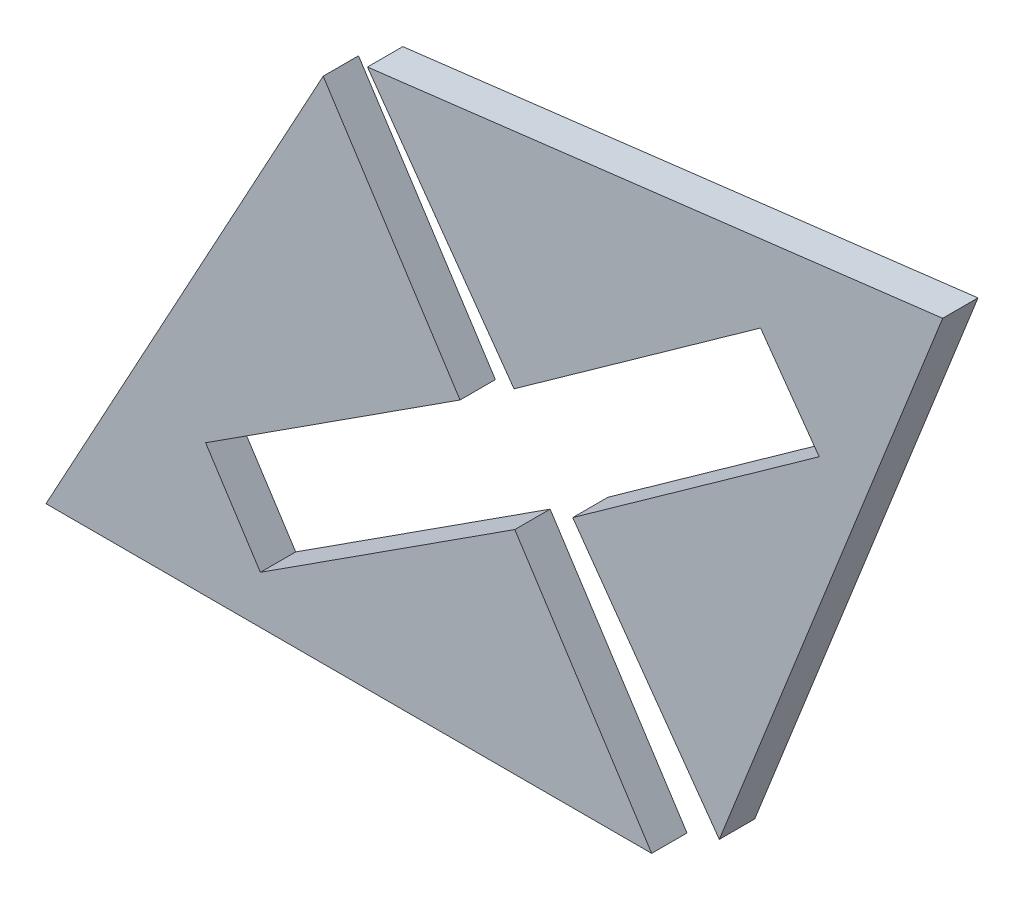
ISO-10303-21;
HEADER;
FILE_DESCRIPTION(('STEP AP214'),'2;1');
FILE_NAME('part.step','',(''),(''),'','','');
FILE_SCHEMA(('AUTOMOTIVE_DESIGN { 1 0 10303 214 1 1 1 1 }'));
ENDSEC;
DATA;
#1=APPLICATION_CONTEXT('core data for automotive mechanical design processes');
#2=APPLICATION_PROTOCOL_DEFINITION('international standard','automotive_design',2000,#1);
#3=PRODUCT_CONTEXT('',#1,'mechanical');
#4=PRODUCT('Part','Part','',(#3));
#5=PRODUCT_RELATED_PRODUCT_CATEGORY('part','',(#4));
#6=PRODUCT_DEFINITION_FORMATION('','',#4);
#7=PRODUCT_DEFINITION_CONTEXT('part definition',#1,'design');
#8=PRODUCT_DEFINITION('design','',#6,#7);
#9=PRODUCT_DEFINITION_SHAPE('','',#8);
#10=(LENGTH_UNIT() NAMED_UNIT(*) SI_UNIT(.MILLI.,.METRE.));
#11=(NAMED_UNIT(*) PLANE_ANGLE_UNIT() SI_UNIT($,.RADIAN.));
#12=(NAMED_UNIT(*) SI_UNIT($,.STERADIAN.) SOLID_ANGLE_UNIT());
#13=UNCERTAINTY_MEASURE_WITH_UNIT(LENGTH_MEASURE(1.E-05),#10,'distance_accuracy_value','');
#14=(GEOMETRIC_REPRESENTATION_CONTEXT(3) GLOBAL_UNCERTAINTY_ASSIGNED_CONTEXT((#13)) GLOBAL_UNIT_ASSIGNED_CONTEXT((#10,
#11,#12)) REPRESENTATION_CONTEXT('',''));
#15=CARTESIAN_POINT('',(0.,0.,0.));
#16=DIRECTION('',(0.,0.,1.));
#17=DIRECTION('',(1.,0.,0.));
#18=AXIS2_PLACEMENT_3D('',#15,#16,#17);
#19=CARTESIAN_POINT('',(-2.81081929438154,24.0227833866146,3.5));
#20=DIRECTION('',(-0.580924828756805,0.813957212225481,0.));
#21=DIRECTION('',(-0.813957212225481,-0.580924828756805,0.));
#22=AXIS2_PLACEMENT_3D('',#19,#20,#21);
#23=PLANE('',#22);
#24=DIRECTION('',(0.813957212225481,0.580924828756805,0.));
#25=VECTOR('',#24,1.);
#26=CARTESIAN_POINT('',(-2.81081929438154,24.0227833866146,0.));
#27=LINE('',#26,#25);
#28=CARTESIAN_POINT('',(-2.81081929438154,24.0227833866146,0.));
#29=VERTEX_POINT('',#28);
#30=CARTESIAN_POINT('',(21.6078970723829,41.4505282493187,0.));
#31=VERTEX_POINT('',#30);
#32=EDGE_CURVE('E132',#29,#31,#27,.T.);
#33=ORIENTED_EDGE('',*,*,#32,.T.);
#34=DIRECTION('',(0.,0.,-1.));
#35=VECTOR('',#34,1.);
#36=CARTESIAN_POINT('',(21.6078970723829,41.4505282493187,3.5));
#37=LINE('',#36,#35);
#38=CARTESIAN_POINT('',(21.6078970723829,41.4505282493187,3.5));
#39=VERTEX_POINT('',#38);
#40=EDGE_CURVE('E12',#39,#31,#37,.T.);
#41=ORIENTED_EDGE('',*,*,#40,.F.);
#42=DIRECTION('',(0.813957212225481,0.580924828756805,0.));
#43=VECTOR('',#42,1.);
#44=CARTESIAN_POINT('',(-2.81081929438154,24.0227833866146,3.5));
#45=LINE('',#44,#43);
#46=CARTESIAN_POINT('',(-2.81081929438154,24.0227833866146,3.5));
#47=VERTEX_POINT('',#46);
#48=EDGE_CURVE('E144',#47,#39,#45,.T.);
#49=ORIENTED_EDGE('',*,*,#48,.F.);
#50=DIRECTION('',(0.,0.,-1.));
#51=VECTOR('',#50,1.);
#52=CARTESIAN_POINT('',(-2.81081929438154,24.0227833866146,3.5));
#53=LINE('',#52,#51);
#54=EDGE_CURVE('E128',#47,#29,#53,.T.);
#55=ORIENTED_EDGE('',*,*,#54,.T.);
#56=EDGE_LOOP('',(#33,#41,#49,#55));
#57=FACE_BOUND('',#56,.T.);
#58=ADVANCED_FACE('F42',(#57),#23,.F.);
#59=CARTESIAN_POINT('',(21.6078970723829,41.4505282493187,3.5));
#60=DIRECTION('',(0.813957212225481,0.580924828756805,0.));
#61=DIRECTION('',(-0.580924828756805,0.813957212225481,0.));
#62=AXIS2_PLACEMENT_3D('',#59,#60,#61);
#63=PLANE('',#62);
#64=DIRECTION('',(0.580924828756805,-0.813957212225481,0.));
#65=VECTOR('',#64,1.);
#66=CARTESIAN_POINT('',(21.6078970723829,41.4505282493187,0.));
#67=LINE('',#66,#65);
#68=CARTESIAN_POINT('',(27.4171453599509,33.3109561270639,0.));
#69=VERTEX_POINT('',#68);
#70=EDGE_CURVE('E135',#31,#69,#67,.T.);
#71=ORIENTED_EDGE('',*,*,#70,.T.);
#72=DIRECTION('',(0.,0.,-1.));
#73=VECTOR('',#72,1.);
#74=CARTESIAN_POINT('',(27.4171453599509,33.3109561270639,3.5));
#75=LINE('',#74,#73);
#76=CARTESIAN_POINT('',(27.4171453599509,33.3109561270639,3.5));
#77=VERTEX_POINT('',#76);
#78=EDGE_CURVE('E50',#77,#69,#75,.T.);
#79=ORIENTED_EDGE('',*,*,#78,.F.);
#80=DIRECTION('',(0.580924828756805,-0.813957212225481,0.));
#81=VECTOR('',#80,1.);
#82=CARTESIAN_POINT('',(21.6078970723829,41.4505282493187,3.5));
#83=LINE('',#82,#81);
#84=EDGE_CURVE('E98',#39,#77,#83,.T.);
#85=ORIENTED_EDGE('',*,*,#84,.F.);
#86=ORIENTED_EDGE('',*,*,#40,.T.);
#87=EDGE_LOOP('',(#71,#79,#85,#86));
#88=FACE_BOUND('',#87,.T.);
#89=ADVANCED_FACE('F169',(#88),#63,.F.);
#90=CARTESIAN_POINT('',(27.4171453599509,33.3109561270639,3.5));
#91=DIRECTION('',(0.580924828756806,-0.813957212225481,0.));
#92=DIRECTION('',(0.813957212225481,0.580924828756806,0.));
#93=AXIS2_PLACEMENT_3D('',#90,#91,#92);
#94=PLANE('',#93);
#95=DIRECTION('',(-0.813957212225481,-0.580924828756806,0.));
#96=VECTOR('',#95,1.);
#97=CARTESIAN_POINT('',(27.4171453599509,33.3109561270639,0.));
#98=LINE('',#97,#96);
#99=CARTESIAN_POINT('',(2.99842899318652,15.8832112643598,0.));
#100=VERTEX_POINT('',#99);
#101=EDGE_CURVE('E137',#69,#100,#98,.T.);
#102=ORIENTED_EDGE('',*,*,#101,.T.);
#103=DIRECTION('',(0.,0.,-1.));
#104=VECTOR('',#103,1.);
#105=CARTESIAN_POINT('',(2.99842899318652,15.8832112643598,3.5));
#106=LINE('',#105,#104);
#107=CARTESIAN_POINT('',(2.99842899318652,15.8832112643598,3.5));
#108=VERTEX_POINT('',#107);
#109=EDGE_CURVE('E148',#108,#100,#106,.T.);
#110=ORIENTED_EDGE('',*,*,#109,.F.);
#111=DIRECTION('',(-0.813957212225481,-0.580924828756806,0.));
#112=VECTOR('',#111,1.);
#113=CARTESIAN_POINT('',(27.4171453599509,33.3109561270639,3.5));
#114=LINE('',#113,#112);
#115=EDGE_CURVE('E156',#77,#108,#114,.T.);
#116=ORIENTED_EDGE('',*,*,#115,.F.);
#117=ORIENTED_EDGE('',*,*,#78,.T.);
#118=EDGE_LOOP('',(#102,#110,#116,#117));
#119=FACE_BOUND('',#118,.T.);
#120=ADVANCED_FACE('F154',(#119),#94,.F.);
#121=CARTESIAN_POINT('',(17.5215497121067,-4.46571904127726,3.5));
#122=DIRECTION('',(0.813957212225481,0.580924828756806,0.));
#123=DIRECTION('',(-0.580924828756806,0.813957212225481,0.));
#124=AXIS2_PLACEMENT_3D('',#121,#122,#123);
#125=PLANE('',#124);
#126=DIRECTION('',(0.580924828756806,-0.813957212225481,0.));
#127=VECTOR('',#126,1.);
#128=CARTESIAN_POINT('',(17.5215497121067,-4.46571904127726,0.));
#129=LINE('',#128,#127);
#130=CARTESIAN_POINT('',(17.5215497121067,-4.46571904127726,0.));
#131=VERTEX_POINT('',#130);
#132=EDGE_CURVE('E139',#100,#131,#129,.T.);
#133=ORIENTED_EDGE('',*,*,#132,.T.);
#134=DIRECTION('',(0.,0.,-1.));
#135=VECTOR('',#134,1.);
#136=CARTESIAN_POINT('',(17.5215497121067,-4.46571904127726,3.5));
#137=LINE('',#136,#135);
#138=CARTESIAN_POINT('',(17.5215497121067,-4.46571904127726,3.5));
#139=VERTEX_POINT('',#138);
#140=EDGE_CURVE('E123',#139,#131,#137,.T.);
#141=ORIENTED_EDGE('',*,*,#140,.F.);
#142=DIRECTION('',(0.580924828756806,-0.813957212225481,0.));
#143=VECTOR('',#142,1.);
#144=CARTESIAN_POINT('',(17.5215497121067,-4.46571904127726,3.5));
#145=LINE('',#144,#143);
#146=EDGE_CURVE('E114',#108,#139,#145,.T.);
#147=ORIENTED_EDGE('',*,*,#146,.F.);
#148=ORIENTED_EDGE('',*,*,#109,.T.);
#149=EDGE_LOOP('',(#133,#141,#147,#148));
#150=FACE_BOUND('',#149,.T.);
#151=ADVANCED_FACE('F162',(#150),#125,.F.);
#152=CARTESIAN_POINT('',(39.6479721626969,51.3054332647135,3.5));
#153=DIRECTION('',(-0.929519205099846,0.368773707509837,0.));
#154=DIRECTION('',(-0.368773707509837,-0.929519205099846,0.));
#155=AXIS2_PLACEMENT_3D('',#152,#153,#154);
#156=PLANE('',#155);
#157=DIRECTION('',(0.368773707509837,0.929519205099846,0.));
#158=VECTOR('',#157,1.);
#159=CARTESIAN_POINT('',(39.6479721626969,51.3054332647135,0.));
#160=LINE('',#159,#158);
#161=CARTESIAN_POINT('',(39.6479721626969,51.3054332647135,0.));
#162=VERTEX_POINT('',#161);
#163=EDGE_CURVE('E122',#131,#162,#160,.T.);
#164=ORIENTED_EDGE('',*,*,#163,.T.);
#165=DIRECTION('',(0.,0.,-1.));
#166=VECTOR('',#165,1.);
#167=CARTESIAN_POINT('',(39.6479721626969,51.3054332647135,3.5));
#168=LINE('',#167,#166);
#169=CARTESIAN_POINT('',(39.6479721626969,51.3054332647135,3.5));
#170=VERTEX_POINT('',#169);
#171=EDGE_CURVE('E119',#170,#162,#168,.T.);
#172=ORIENTED_EDGE('',*,*,#171,.F.);
#173=DIRECTION('',(0.368773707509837,0.929519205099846,0.));
#174=VECTOR('',#173,1.);
#175=CARTESIAN_POINT('',(39.6479721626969,51.3054332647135,3.5));
#176=LINE('',#175,#174);
#177=EDGE_CURVE('E108',#139,#170,#176,.T.);
#178=ORIENTED_EDGE('',*,*,#177,.F.);
#179=ORIENTED_EDGE('',*,*,#140,.T.);
#180=EDGE_LOOP('',(#164,#172,#178,#179));
#181=FACE_BOUND('',#180,.T.);
#182=ADVANCED_FACE('F120',(#181),#156,.F.);
#183=CARTESIAN_POINT('',(-17.3339400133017,44.3717136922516,3.5));
#184=DIRECTION('',(0.120791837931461,-0.992677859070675,0.));
#185=DIRECTION('',(0.992677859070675,0.120791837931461,0.));
#186=AXIS2_PLACEMENT_3D('',#183,#184,#185);
#187=PLANE('',#186);
#188=DIRECTION('',(-0.992677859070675,-0.120791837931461,0.));
#189=VECTOR('',#188,1.);
#190=CARTESIAN_POINT('',(-17.3339400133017,44.3717136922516,0.));
#191=LINE('',#190,#189);
#192=CARTESIAN_POINT('',(-17.3339400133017,44.3717136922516,0.));
#193=VERTEX_POINT('',#192);
#194=EDGE_CURVE('E84',#162,#193,#191,.T.);
#195=ORIENTED_EDGE('',*,*,#194,.T.);
#196=DIRECTION('',(0.,0.,-1.));
#197=VECTOR('',#196,1.);
#198=CARTESIAN_POINT('',(-17.3339400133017,44.3717136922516,3.5));
#199=LINE('',#198,#197);
#200=CARTESIAN_POINT('',(-17.3339400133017,44.3717136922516,3.5));
#201=VERTEX_POINT('',#200);
#202=EDGE_CURVE('E124',#201,#193,#199,.T.);
#203=ORIENTED_EDGE('',*,*,#202,.F.);
#204=DIRECTION('',(-0.992677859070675,-0.120791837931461,0.));
#205=VECTOR('',#204,1.);
#206=CARTESIAN_POINT('',(-17.3339400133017,44.3717136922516,3.5));
#207=LINE('',#206,#205);
#208=EDGE_CURVE('E112',#170,#201,#207,.T.);
#209=ORIENTED_EDGE('',*,*,#208,.F.);
#210=ORIENTED_EDGE('',*,*,#171,.T.);
#211=EDGE_LOOP('',(#195,#203,#209,#210));
#212=FACE_BOUND('',#211,.T.);
#213=ADVANCED_FACE('F126',(#212),#187,.F.);
#214=CARTESIAN_POINT('',(-2.81081929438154,24.0227833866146,3.5));
#215=DIRECTION('',(0.813957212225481,0.580924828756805,0.));
#216=DIRECTION('',(-0.580924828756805,0.813957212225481,0.));
#217=AXIS2_PLACEMENT_3D('',#214,#215,#216);
#218=PLANE('',#217);
#219=DIRECTION('',(0.580924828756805,-0.813957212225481,0.));
#220=VECTOR('',#219,1.);
#221=CARTESIAN_POINT('',(-2.81081929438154,24.0227833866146,0.));
#222=LINE('',#221,#220);
#223=EDGE_CURVE('E90',#193,#29,#222,.T.);
#224=ORIENTED_EDGE('',*,*,#223,.T.);
#225=ORIENTED_EDGE('',*,*,#54,.F.);
#226=DIRECTION('',(0.580924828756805,-0.813957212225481,0.));
#227=VECTOR('',#226,1.);
#228=CARTESIAN_POINT('',(-2.81081929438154,24.0227833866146,3.5));
#229=LINE('',#228,#227);
#230=EDGE_CURVE('E58',#201,#47,#229,.T.);
#231=ORIENTED_EDGE('',*,*,#230,.F.);
#232=ORIENTED_EDGE('',*,*,#202,.T.);
#233=EDGE_LOOP('',(#224,#225,#231,#232));
#234=FACE_BOUND('',#233,.T.);
#235=ADVANCED_FACE('F183',(#234),#218,.F.);
#236=CARTESIAN_POINT('',(0.,0.,3.5));
#237=DIRECTION('',(0.,0.,-1.));
#238=DIRECTION('',(-1.,0.,0.));
#239=AXIS2_PLACEMENT_3D('',#236,#237,#238);
#240=PLANE('',#239);
#241=ORIENTED_EDGE('',*,*,#48,.T.);
#242=ORIENTED_EDGE('',*,*,#84,.T.);
#243=ORIENTED_EDGE('',*,*,#115,.T.);
#244=ORIENTED_EDGE('',*,*,#146,.T.);
#245=ORIENTED_EDGE('',*,*,#177,.T.);
#246=ORIENTED_EDGE('',*,*,#208,.T.);
#247=ORIENTED_EDGE('',*,*,#230,.T.);
#248=EDGE_LOOP('',(#241,#242,#243,#244,#245,#246,#247));
#249=FACE_BOUND('',#248,.T.);
#250=ADVANCED_FACE('F110',(#249),#240,.F.);
#251=CARTESIAN_POINT('',(0.,0.,0.));
#252=DIRECTION('',(0.,0.,-1.));
#253=DIRECTION('',(-1.,0.,0.));
#254=AXIS2_PLACEMENT_3D('',#251,#252,#253);
#255=PLANE('',#254);
#256=ORIENTED_EDGE('',*,*,#32,.F.);
#257=ORIENTED_EDGE('',*,*,#223,.F.);
#258=ORIENTED_EDGE('',*,*,#194,.F.);
#259=ORIENTED_EDGE('',*,*,#163,.F.);
#260=ORIENTED_EDGE('',*,*,#132,.F.);
#261=ORIENTED_EDGE('',*,*,#101,.F.);
#262=ORIENTED_EDGE('',*,*,#70,.F.);
#263=EDGE_LOOP('',(#256,#257,#258,#259,#260,#261,#262));
#264=FACE_BOUND('',#263,.T.);
#265=ADVANCED_FACE('F160',(#264),#255,.T.);
#266=CLOSED_SHELL('',(#58,#89,#120,#151,#182,#213,#235,#250,#265));
#267=MANIFOLD_SOLID_BREP('B2',#266);
#268=CARTESIAN_POINT('',(-8.16189213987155,20.3889285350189,3.5));
#269=DIRECTION('',(-0.840146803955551,-0.542359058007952,0.));
#270=DIRECTION('',(0.542359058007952,-0.840146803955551,0.));
#271=AXIS2_PLACEMENT_3D('',#268,#269,#270);
#272=PLANE('',#271);
#273=DIRECTION('',(-0.542359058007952,0.840146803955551,0.));
#274=VECTOR('',#273,1.);
#275=CARTESIAN_POINT('',(-8.16189213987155,20.3889285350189,0.));
#276=LINE('',#275,#274);
#277=CARTESIAN_POINT('',(-8.16189213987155,20.3889285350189,0.));
#278=VERTEX_POINT('',#277);
#279=CARTESIAN_POINT('',(-21.7208685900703,41.3925986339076,0.));
#280=VERTEX_POINT('',#279);
#281=EDGE_CURVE('E333',#278,#280,#276,.T.);
#282=ORIENTED_EDGE('',*,*,#281,.T.);
#283=DIRECTION('',(0.,0.,-1.));
#284=VECTOR('',#283,1.);
#285=CARTESIAN_POINT('',(-21.7208685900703,41.3925986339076,3.5));
#286=LINE('',#285,#284);
#287=CARTESIAN_POINT('',(-21.7208685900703,41.3925986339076,3.5));
#288=VERTEX_POINT('',#287);
#289=EDGE_CURVE('E40',#288,#280,#286,.T.);
#290=ORIENTED_EDGE('',*,*,#289,.F.);
#291=DIRECTION('',(-0.542359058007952,0.840146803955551,0.));
#292=VECTOR('',#291,1.);
#293=CARTESIAN_POINT('',(-8.16189213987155,20.3889285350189,3.5));
#294=LINE('',#293,#292);
#295=CARTESIAN_POINT('',(-8.16189213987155,20.3889285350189,3.5));
#296=VERTEX_POINT('',#295);
#297=EDGE_CURVE('E345',#296,#288,#294,.T.);
#298=ORIENTED_EDGE('',*,*,#297,.F.);
#299=DIRECTION('',(0.,0.,-1.));
#300=VECTOR('',#299,1.);
#301=CARTESIAN_POINT('',(-8.16189213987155,20.3889285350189,3.5));
#302=LINE('',#301,#300);
#303=EDGE_CURVE('E329',#296,#278,#302,.T.);
#304=ORIENTED_EDGE('',*,*,#303,.T.);
#305=EDGE_LOOP('',(#282,#290,#298,#304));
#306=FACE_BOUND('',#305,.T.);
#307=ADVANCED_FACE('F243',(#306),#272,.F.);
#308=CARTESIAN_POINT('',(-21.7208685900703,41.3925986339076,3.5));
#309=DIRECTION('',(0.878168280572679,-0.478351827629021,0.));
#310=DIRECTION('',(0.478351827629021,0.878168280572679,0.));
#311=AXIS2_PLACEMENT_3D('',#308,#309,#310);
#312=PLANE('',#311);
#313=DIRECTION('',(-0.478351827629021,-0.878168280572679,0.));
#314=VECTOR('',#313,1.);
#315=CARTESIAN_POINT('',(-21.7208685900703,41.3925986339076,0.));
#316=LINE('',#315,#314);
#317=CARTESIAN_POINT('',(-49.1793251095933,-9.01620960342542,0.));
#318=VERTEX_POINT('',#317);
#319=EDGE_CURVE('E336',#280,#318,#316,.T.);
#320=ORIENTED_EDGE('',*,*,#319,.T.);
#321=DIRECTION('',(0.,0.,-1.));
#322=VECTOR('',#321,1.);
#323=CARTESIAN_POINT('',(-49.1793251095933,-9.01620960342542,3.5));
#324=LINE('',#323,#322);
#325=CARTESIAN_POINT('',(-49.1793251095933,-9.01620960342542,3.5));
#326=VERTEX_POINT('',#325);
#327=EDGE_CURVE('E251',#326,#318,#324,.T.);
#328=ORIENTED_EDGE('',*,*,#327,.F.);
#329=DIRECTION('',(-0.478351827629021,-0.878168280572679,0.));
#330=VECTOR('',#329,1.);
#331=CARTESIAN_POINT('',(-21.7208685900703,41.3925986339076,3.5));
#332=LINE('',#331,#330);
#333=EDGE_CURVE('E299',#288,#326,#332,.T.);
#334=ORIENTED_EDGE('',*,*,#333,.F.);
#335=ORIENTED_EDGE('',*,*,#289,.T.);
#336=EDGE_LOOP('',(#320,#328,#334,#335));
#337=FACE_BOUND('',#336,.T.);
#338=ADVANCED_FACE('F370',(#337),#312,.F.);
#339=CARTESIAN_POINT('',(-49.1793251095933,-9.01620960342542,3.5));
#340=DIRECTION('',(0.,1.,0.));
#341=DIRECTION('',(0.,0.,1.));
#342=AXIS2_PLACEMENT_3D('',#339,#340,#341);
#343=PLANE('',#342);
#344=DIRECTION('',(1.,0.,0.));
#345=VECTOR('',#344,1.);
#346=CARTESIAN_POINT('',(-49.1793251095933,-9.01620960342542,0.));
#347=LINE('',#346,#345);
#348=CARTESIAN_POINT('',(10.8206748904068,-9.01620960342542,0.));
#349=VERTEX_POINT('',#348);
#350=EDGE_CURVE('E338',#318,#349,#347,.T.);
#351=ORIENTED_EDGE('',*,*,#350,.T.);
#352=DIRECTION('',(0.,0.,-1.));
#353=VECTOR('',#352,1.);
#354=CARTESIAN_POINT('',(10.8206748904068,-9.01620960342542,3.5));
#355=LINE('',#354,#353);
#356=CARTESIAN_POINT('',(10.8206748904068,-9.01620960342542,3.5));
#357=VERTEX_POINT('',#356);
#358=EDGE_CURVE('E349',#357,#349,#355,.T.);
#359=ORIENTED_EDGE('',*,*,#358,.F.);
#360=DIRECTION('',(1.,0.,0.));
#361=VECTOR('',#360,1.);
#362=CARTESIAN_POINT('',(-49.1793251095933,-9.01620960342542,3.5));
#363=LINE('',#362,#361);
#364=EDGE_CURVE('E357',#326,#357,#363,.T.);
#365=ORIENTED_EDGE('',*,*,#364,.F.);
#366=ORIENTED_EDGE('',*,*,#327,.T.);
#367=EDGE_LOOP('',(#351,#359,#365,#366));
#368=FACE_BOUND('',#367,.T.);
#369=ADVANCED_FACE('F355',(#368),#343,.F.);
#370=CARTESIAN_POINT('',(10.8206748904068,-9.01620960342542,3.5));
#371=DIRECTION('',(-0.840146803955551,-0.542359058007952,0.));
#372=DIRECTION('',(0.542359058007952,-0.840146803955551,0.));
#373=AXIS2_PLACEMENT_3D('',#370,#371,#372);
#374=PLANE('',#373);
#375=DIRECTION('',(-0.542359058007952,0.840146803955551,0.));
#376=VECTOR('',#375,1.);
#377=CARTESIAN_POINT('',(10.8206748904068,-9.01620960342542,0.));
#378=LINE('',#377,#376);
#379=CARTESIAN_POINT('',(-2.73830155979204,11.9874604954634,0.));
#380=VERTEX_POINT('',#379);
#381=EDGE_CURVE('E340',#349,#380,#378,.T.);
#382=ORIENTED_EDGE('',*,*,#381,.T.);
#383=DIRECTION('',(0.,0.,-1.));
#384=VECTOR('',#383,1.);
#385=CARTESIAN_POINT('',(-2.73830155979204,11.9874604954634,3.5));
#386=LINE('',#385,#384);
#387=CARTESIAN_POINT('',(-2.73830155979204,11.9874604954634,3.5));
#388=VERTEX_POINT('',#387);
#389=EDGE_CURVE('E324',#388,#380,#386,.T.);
#390=ORIENTED_EDGE('',*,*,#389,.F.);
#391=DIRECTION('',(-0.542359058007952,0.840146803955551,0.));
#392=VECTOR('',#391,1.);
#393=CARTESIAN_POINT('',(10.8206748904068,-9.01620960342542,3.5));
#394=LINE('',#393,#392);
#395=EDGE_CURVE('E315',#357,#388,#394,.T.);
#396=ORIENTED_EDGE('',*,*,#395,.F.);
#397=ORIENTED_EDGE('',*,*,#358,.T.);
#398=EDGE_LOOP('',(#382,#390,#396,#397));
#399=FACE_BOUND('',#398,.T.);
#400=ADVANCED_FACE('F363',(#399),#374,.F.);
#401=CARTESIAN_POINT('',(-27.9427056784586,-4.28331124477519,3.5));
#402=DIRECTION('',(0.542359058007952,-0.840146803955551,0.));
#403=DIRECTION('',(0.840146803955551,0.542359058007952,0.));
#404=AXIS2_PLACEMENT_3D('',#401,#402,#403);
#405=PLANE('',#404);
#406=DIRECTION('',(-0.840146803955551,-0.542359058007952,0.));
#407=VECTOR('',#406,1.);
#408=CARTESIAN_POINT('',(-27.9427056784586,-4.28331124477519,0.));
#409=LINE('',#408,#407);
#410=CARTESIAN_POINT('',(-27.9427056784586,-4.28331124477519,0.));
#411=VERTEX_POINT('',#410);
#412=EDGE_CURVE('E323',#380,#411,#409,.T.);
#413=ORIENTED_EDGE('',*,*,#412,.T.);
#414=DIRECTION('',(0.,0.,-1.));
#415=VECTOR('',#414,1.);
#416=CARTESIAN_POINT('',(-27.9427056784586,-4.28331124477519,3.5));
#417=LINE('',#416,#415);
#418=CARTESIAN_POINT('',(-27.9427056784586,-4.28331124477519,3.5));
#419=VERTEX_POINT('',#418);
#420=EDGE_CURVE('E320',#419,#411,#417,.T.);
#421=ORIENTED_EDGE('',*,*,#420,.F.);
#422=DIRECTION('',(-0.840146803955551,-0.542359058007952,0.));
#423=VECTOR('',#422,1.);
#424=CARTESIAN_POINT('',(-27.9427056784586,-4.28331124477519,3.5));
#425=LINE('',#424,#423);
#426=EDGE_CURVE('E309',#388,#419,#425,.T.);
#427=ORIENTED_EDGE('',*,*,#426,.F.);
#428=ORIENTED_EDGE('',*,*,#389,.T.);
#429=EDGE_LOOP('',(#413,#421,#427,#428));
#430=FACE_BOUND('',#429,.T.);
#431=ADVANCED_FACE('F321',(#430),#405,.F.);
#432=CARTESIAN_POINT('',(-33.3662962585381,4.11815679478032,3.5));
#433=DIRECTION('',(-0.840146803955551,-0.542359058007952,0.));
#434=DIRECTION('',(0.542359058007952,-0.840146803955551,0.));
#435=AXIS2_PLACEMENT_3D('',#432,#433,#434);
#436=PLANE('',#435);
#437=DIRECTION('',(-0.542359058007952,0.840146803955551,0.));
#438=VECTOR('',#437,1.);
#439=CARTESIAN_POINT('',(-33.3662962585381,4.11815679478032,0.));
#440=LINE('',#439,#438);
#441=CARTESIAN_POINT('',(-33.3662962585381,4.11815679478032,0.));
#442=VERTEX_POINT('',#441);
#443=EDGE_CURVE('E285',#411,#442,#440,.T.);
#444=ORIENTED_EDGE('',*,*,#443,.T.);
#445=DIRECTION('',(0.,0.,-1.));
#446=VECTOR('',#445,1.);
#447=CARTESIAN_POINT('',(-33.3662962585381,4.11815679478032,3.5));
#448=LINE('',#447,#446);
#449=CARTESIAN_POINT('',(-33.3662962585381,4.11815679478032,3.5));
#450=VERTEX_POINT('',#449);
#451=EDGE_CURVE('E325',#450,#442,#448,.T.);
#452=ORIENTED_EDGE('',*,*,#451,.F.);
#453=DIRECTION('',(-0.542359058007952,0.840146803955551,0.));
#454=VECTOR('',#453,1.);
#455=CARTESIAN_POINT('',(-33.3662962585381,4.11815679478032,3.5));
#456=LINE('',#455,#454);
#457=EDGE_CURVE('E313',#419,#450,#456,.T.);
#458=ORIENTED_EDGE('',*,*,#457,.F.);
#459=ORIENTED_EDGE('',*,*,#420,.T.);
#460=EDGE_LOOP('',(#444,#452,#458,#459));
#461=FACE_BOUND('',#460,.T.);
#462=ADVANCED_FACE('F327',(#461),#436,.F.);
#463=CARTESIAN_POINT('',(-8.16189213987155,20.3889285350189,3.5));
#464=DIRECTION('',(-0.542359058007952,0.840146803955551,0.));
#465=DIRECTION('',(-0.840146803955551,-0.542359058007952,0.));
#466=AXIS2_PLACEMENT_3D('',#463,#464,#465);
#467=PLANE('',#466);
#468=DIRECTION('',(0.840146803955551,0.542359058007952,0.));
#469=VECTOR('',#468,1.);
#470=CARTESIAN_POINT('',(-8.16189213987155,20.3889285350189,0.));
#471=LINE('',#470,#469);
#472=EDGE_CURVE('E291',#442,#278,#471,.T.);
#473=ORIENTED_EDGE('',*,*,#472,.T.);
#474=ORIENTED_EDGE('',*,*,#303,.F.);
#475=DIRECTION('',(0.840146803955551,0.542359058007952,0.));
#476=VECTOR('',#475,1.);
#477=CARTESIAN_POINT('',(-8.16189213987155,20.3889285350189,3.5));
#478=LINE('',#477,#476);
#479=EDGE_CURVE('E259',#450,#296,#478,.T.);
#480=ORIENTED_EDGE('',*,*,#479,.F.);
#481=ORIENTED_EDGE('',*,*,#451,.T.);
#482=EDGE_LOOP('',(#473,#474,#480,#481));
#483=FACE_BOUND('',#482,.T.);
#484=ADVANCED_FACE('F384',(#483),#467,.F.);
#485=CARTESIAN_POINT('',(0.,0.,3.5));
#486=DIRECTION('',(0.,0.,-1.));
#487=DIRECTION('',(-1.,0.,0.));
#488=AXIS2_PLACEMENT_3D('',#485,#486,#487);
#489=PLANE('',#488);
#490=ORIENTED_EDGE('',*,*,#297,.T.);
#491=ORIENTED_EDGE('',*,*,#333,.T.);
#492=ORIENTED_EDGE('',*,*,#364,.T.);
#493=ORIENTED_EDGE('',*,*,#395,.T.);
#494=ORIENTED_EDGE('',*,*,#426,.T.);
#495=ORIENTED_EDGE('',*,*,#457,.T.);
#496=ORIENTED_EDGE('',*,*,#479,.T.);
#497=EDGE_LOOP('',(#490,#491,#492,#493,#494,#495,#496));
#498=FACE_BOUND('',#497,.T.);
#499=ADVANCED_FACE('F311',(#498),#489,.F.);
#500=CARTESIAN_POINT('',(0.,0.,0.));
#501=DIRECTION('',(0.,0.,-1.));
#502=DIRECTION('',(-1.,0.,0.));
#503=AXIS2_PLACEMENT_3D('',#500,#501,#502);
#504=PLANE('',#503);
#505=ORIENTED_EDGE('',*,*,#281,.F.);
#506=ORIENTED_EDGE('',*,*,#472,.F.);
#507=ORIENTED_EDGE('',*,*,#443,.F.);
#508=ORIENTED_EDGE('',*,*,#412,.F.);
#509=ORIENTED_EDGE('',*,*,#381,.F.);
#510=ORIENTED_EDGE('',*,*,#350,.F.);
#511=ORIENTED_EDGE('',*,*,#319,.F.);
#512=EDGE_LOOP('',(#505,#506,#507,#508,#509,#510,#511));
#513=FACE_BOUND('',#512,.T.);
#514=ADVANCED_FACE('F361',(#513),#504,.T.);
#515=CLOSED_SHELL('',(#307,#338,#369,#400,#431,#462,#484,#499,#514));
#516=MANIFOLD_SOLID_BREP('B6',#515);
#517=ADVANCED_BREP_SHAPE_REPRESENTATION('',(#18,#267,#516),#14);
#518=SHAPE_DEFINITION_REPRESENTATION(#9,#517);
ENDSEC;
END-ISO-10303-21;
